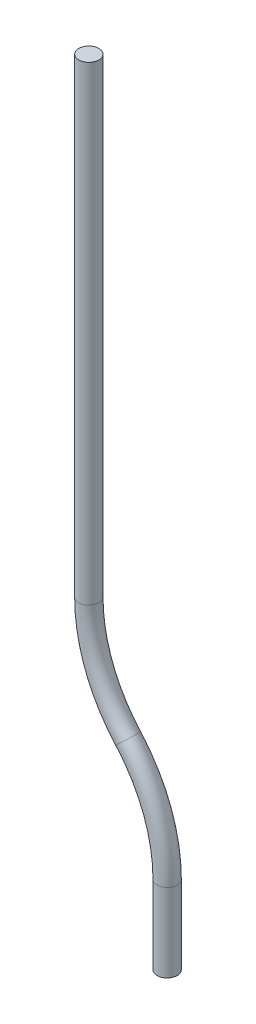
ISO-10303-21;
HEADER;
FILE_DESCRIPTION(('STEP AP214'),'2;1');
FILE_NAME('part.step','',(''),(''),'','','');
FILE_SCHEMA(('AUTOMOTIVE_DESIGN { 1 0 10303 214 1 1 1 1 }'));
ENDSEC;
DATA;
#1=APPLICATION_CONTEXT('core data for automotive mechanical design processes');
#2=APPLICATION_PROTOCOL_DEFINITION('international standard','automotive_design',2000,#1);
#3=PRODUCT_CONTEXT('',#1,'mechanical');
#4=PRODUCT('Part','Part','',(#3));
#5=PRODUCT_RELATED_PRODUCT_CATEGORY('part','',(#4));
#6=PRODUCT_DEFINITION_FORMATION('','',#4);
#7=PRODUCT_DEFINITION_CONTEXT('part definition',#1,'design');
#8=PRODUCT_DEFINITION('design','',#6,#7);
#9=PRODUCT_DEFINITION_SHAPE('','',#8);
#10=(LENGTH_UNIT() NAMED_UNIT(*) SI_UNIT(.MILLI.,.METRE.));
#11=(NAMED_UNIT(*) PLANE_ANGLE_UNIT() SI_UNIT($,.RADIAN.));
#12=(NAMED_UNIT(*) SI_UNIT($,.STERADIAN.) SOLID_ANGLE_UNIT());
#13=UNCERTAINTY_MEASURE_WITH_UNIT(LENGTH_MEASURE(1.E-05),#10,'distance_accuracy_value','');
#14=(GEOMETRIC_REPRESENTATION_CONTEXT(3) GLOBAL_UNCERTAINTY_ASSIGNED_CONTEXT((#13)) GLOBAL_UNIT_ASSIGNED_CONTEXT((#10,
#11,#12)) REPRESENTATION_CONTEXT('',''));
#15=CARTESIAN_POINT('',(0.,0.,0.));
#16=DIRECTION('',(0.,0.,1.));
#17=DIRECTION('',(1.,0.,0.));
#18=AXIS2_PLACEMENT_3D('',#15,#16,#17);
#19=CARTESIAN_POINT('',(-25.4,91.9945943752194,0.));
#20=DIRECTION('',(0.,1.,0.));
#21=DIRECTION('',(-1.,0.,0.));
#22=AXIS2_PLACEMENT_3D('',#19,#20,#21);
#23=CYLINDRICAL_SURFACE('',#22,3.25);
#24=CARTESIAN_POINT('',(-25.4,91.9945943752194,0.));
#25=DIRECTION('',(0.,1.,0.));
#26=DIRECTION('',(0.,0.,1.));
#27=AXIS2_PLACEMENT_3D('',#24,#25,#26);
#28=CIRCLE('',#27,3.25);
#29=CARTESIAN_POINT('',(-28.65,91.9945943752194,0.));
#30=VERTEX_POINT('',#29);
#31=EDGE_CURVE('E41',#30,#30,#28,.T.);
#32=CARTESIAN_POINT('',(-25.4,244.394594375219,0.));
#33=DIRECTION('',(0.,1.,0.));
#34=DIRECTION('',(0.,0.,1.));
#35=AXIS2_PLACEMENT_3D('',#32,#33,#34);
#36=CIRCLE('',#35,3.25);
#37=CARTESIAN_POINT('',(-28.65,244.394594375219,0.));
#38=VERTEX_POINT('',#37);
#39=EDGE_CURVE('E10',#38,#38,#36,.T.);
#40=CARTESIAN_POINT('',(-28.65,91.9945943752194,0.));
#41=CARTESIAN_POINT('',(-28.65,93.5820943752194,0.));
#42=CARTESIAN_POINT('',(-28.65,95.1695943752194,0.));
#43=CARTESIAN_POINT('',(-28.65,98.3445943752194,0.));
#44=CARTESIAN_POINT('',(-28.65,99.9320943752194,0.));
#45=CARTESIAN_POINT('',(-28.65,103.107094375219,0.));
#46=CARTESIAN_POINT('',(-28.65,104.694594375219,0.));
#47=CARTESIAN_POINT('',(-28.65,107.869594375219,0.));
#48=CARTESIAN_POINT('',(-28.65,109.457094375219,0.));
#49=CARTESIAN_POINT('',(-28.65,112.632094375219,0.));
#50=CARTESIAN_POINT('',(-28.65,114.219594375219,0.));
#51=CARTESIAN_POINT('',(-28.65,117.394594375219,0.));
#52=CARTESIAN_POINT('',(-28.65,118.982094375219,0.));
#53=CARTESIAN_POINT('',(-28.65,122.157094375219,0.));
#54=CARTESIAN_POINT('',(-28.65,123.744594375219,0.));
#55=CARTESIAN_POINT('',(-28.65,126.919594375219,0.));
#56=CARTESIAN_POINT('',(-28.65,128.507094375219,0.));
#57=CARTESIAN_POINT('',(-28.65,131.682094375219,0.));
#58=CARTESIAN_POINT('',(-28.65,133.269594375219,0.));
#59=CARTESIAN_POINT('',(-28.65,136.444594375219,0.));
#60=CARTESIAN_POINT('',(-28.65,138.032094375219,0.));
#61=CARTESIAN_POINT('',(-28.65,141.207094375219,0.));
#62=CARTESIAN_POINT('',(-28.65,142.794594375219,0.));
#63=CARTESIAN_POINT('',(-28.65,145.969594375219,0.));
#64=CARTESIAN_POINT('',(-28.65,147.557094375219,0.));
#65=CARTESIAN_POINT('',(-28.65,150.732094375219,0.));
#66=CARTESIAN_POINT('',(-28.65,152.319594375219,0.));
#67=CARTESIAN_POINT('',(-28.65,155.494594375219,0.));
#68=CARTESIAN_POINT('',(-28.65,157.082094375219,0.));
#69=CARTESIAN_POINT('',(-28.65,160.257094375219,0.));
#70=CARTESIAN_POINT('',(-28.65,161.844594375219,0.));
#71=CARTESIAN_POINT('',(-28.65,165.019594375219,0.));
#72=CARTESIAN_POINT('',(-28.65,166.607094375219,0.));
#73=CARTESIAN_POINT('',(-28.65,169.782094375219,0.));
#74=CARTESIAN_POINT('',(-28.65,171.369594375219,0.));
#75=CARTESIAN_POINT('',(-28.65,174.544594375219,0.));
#76=CARTESIAN_POINT('',(-28.65,176.132094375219,0.));
#77=CARTESIAN_POINT('',(-28.65,179.307094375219,0.));
#78=CARTESIAN_POINT('',(-28.65,180.894594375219,0.));
#79=CARTESIAN_POINT('',(-28.65,184.069594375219,0.));
#80=CARTESIAN_POINT('',(-28.65,185.657094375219,0.));
#81=CARTESIAN_POINT('',(-28.65,188.832094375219,0.));
#82=CARTESIAN_POINT('',(-28.65,190.419594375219,0.));
#83=CARTESIAN_POINT('',(-28.65,193.594594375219,0.));
#84=CARTESIAN_POINT('',(-28.65,195.182094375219,0.));
#85=CARTESIAN_POINT('',(-28.65,198.357094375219,0.));
#86=CARTESIAN_POINT('',(-28.65,199.944594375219,0.));
#87=CARTESIAN_POINT('',(-28.65,203.119594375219,0.));
#88=CARTESIAN_POINT('',(-28.65,204.707094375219,0.));
#89=CARTESIAN_POINT('',(-28.65,207.882094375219,0.));
#90=CARTESIAN_POINT('',(-28.65,209.469594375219,0.));
#91=CARTESIAN_POINT('',(-28.65,212.644594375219,0.));
#92=CARTESIAN_POINT('',(-28.65,214.232094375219,0.));
#93=CARTESIAN_POINT('',(-28.65,217.407094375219,0.));
#94=CARTESIAN_POINT('',(-28.65,218.994594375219,0.));
#95=CARTESIAN_POINT('',(-28.65,222.169594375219,0.));
#96=CARTESIAN_POINT('',(-28.65,223.757094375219,0.));
#97=CARTESIAN_POINT('',(-28.65,226.932094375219,0.));
#98=CARTESIAN_POINT('',(-28.65,228.519594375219,0.));
#99=CARTESIAN_POINT('',(-28.65,231.694594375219,0.));
#100=CARTESIAN_POINT('',(-28.65,233.282094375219,0.));
#101=CARTESIAN_POINT('',(-28.65,236.457094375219,0.));
#102=CARTESIAN_POINT('',(-28.65,238.044594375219,0.));
#103=CARTESIAN_POINT('',(-28.65,241.219594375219,0.));
#104=CARTESIAN_POINT('',(-28.65,242.807094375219,0.));
#105=CARTESIAN_POINT('',(-28.65,244.394594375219,0.));
#106=B_SPLINE_CURVE_WITH_KNOTS('',3,(#40,#41,#42,#43,#44,#45,#46,#47,#48,#49,#50,#51,#52,#53,
#54,#55,#56,#57,#58,#59,#60,#61,#62,#63,#64,#65,#66,#67,#68,#69,#70,#71,#72,#73,#74,#75,#76,#77,
#78,#79,#80,#81,#82,#83,#84,#85,#86,#87,#88,#89,#90,#91,#92,#93,#94,#95,#96,#97,#98,#99,#100,
#101,#102,#103,#104,#105),.UNSPECIFIED.,.F.,.F.,(4,2,2,2,2,2,2,2,2,2,2,2,2,2,2,2,2,2,2,2,2,2,2,
2,2,2,2,2,2,2,2,2,4),(0.,4.7625,9.52500000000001,14.2875,19.05,23.8125,28.575,33.3375,38.1,
42.8625,47.625,52.3875,57.15,61.9125,66.675,71.4375,76.2,80.9625,85.725,90.4875,95.25,100.0125,
104.775,109.5375,114.3,119.0625,123.825,128.5875,133.35,138.1125,142.875,147.6375,152.4),.UNSPECIFIED.);
#107=EDGE_CURVE('BSEAM34',#30,#38,#106,.T.);
#108=ORIENTED_EDGE('',*,*,#31,.T.);
#109=ORIENTED_EDGE('',*,*,#39,.F.);
#110=ORIENTED_EDGE('',*,*,#107,.T.);
#111=ORIENTED_EDGE('',*,*,#107,.F.);
#112=EDGE_LOOP('',(#108,#110,#109,#111));
#113=FACE_BOUND('',#112,.T.);
#114=ADVANCED_FACE('F34',(#113),#23,.T.);
#115=CARTESIAN_POINT('',(24.6,91.9945943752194,0.));
#116=DIRECTION('',(0.,0.,-1.));
#117=DIRECTION('',(-1.,0.,0.));
#118=AXIS2_PLACEMENT_3D('',#115,#116,#117);
#119=TOROIDAL_SURFACE('',#118,50.,3.25);
#120=CARTESIAN_POINT('',(-12.7,58.6972971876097,0.));
#121=DIRECTION('',(-0.665945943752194,0.746,0.));
#122=DIRECTION('',(0.,0.,1.));
#123=AXIS2_PLACEMENT_3D('',#120,#121,#122);
#124=CIRCLE('',#123,3.25);
#125=CARTESIAN_POINT('',(-15.1245,56.5329728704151,0.));
#126=VERTEX_POINT('',#125);
#127=EDGE_CURVE('E45',#126,#126,#124,.T.);
#128=CARTESIAN_POINT('',(24.6,91.9945943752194,0.));
#129=DIRECTION('',(0.,0.,-1.));
#130=DIRECTION('',(-1.,0.,0.));
#131=AXIS2_PLACEMENT_3D('',#128,#129,#130);
#132=CIRCLE('',#131,53.25);
#133=EDGE_CURVE('',#126,#30,#132,.T.);
#134=ORIENTED_EDGE('',*,*,#127,.T.);
#135=ORIENTED_EDGE('',*,*,#31,.F.);
#136=ORIENTED_EDGE('',*,*,#133,.T.);
#137=ORIENTED_EDGE('',*,*,#133,.F.);
#138=EDGE_LOOP('',(#134,#136,#135,#137));
#139=FACE_BOUND('',#138,.T.);
#140=ADVANCED_FACE('F76',(#139),#119,.T.);
#141=CARTESIAN_POINT('',(-50.,25.4,0.));
#142=DIRECTION('',(0.,0.,1.));
#143=DIRECTION('',(1.,0.,0.));
#144=AXIS2_PLACEMENT_3D('',#141,#142,#143);
#145=TOROIDAL_SURFACE('',#144,50.,3.25);
#146=CARTESIAN_POINT('',(0.,25.4,0.));
#147=DIRECTION('',(0.,1.,0.));
#148=DIRECTION('',(0.,0.,1.));
#149=AXIS2_PLACEMENT_3D('',#146,#147,#148);
#150=CIRCLE('',#149,3.25);
#151=CARTESIAN_POINT('',(0.,25.4,3.25));
#152=VERTEX_POINT('',#151);
#153=EDGE_CURVE('E49',#152,#152,#150,.T.);
#154=ORIENTED_EDGE('',*,*,#153,.T.);
#155=EDGE_LOOP('',(#154));
#156=FACE_BOUND('',#155,.T.);
#157=ORIENTED_EDGE('',*,*,#127,.F.);
#158=EDGE_LOOP('',(#157));
#159=FACE_BOUND('',#158,.T.);
#160=ADVANCED_FACE('F58',(#156,#159),#145,.T.);
#161=CARTESIAN_POINT('',(0.,25.4,0.));
#162=DIRECTION('',(0.,-1.,0.));
#163=DIRECTION('',(0.,0.,-1.));
#164=AXIS2_PLACEMENT_3D('',#161,#162,#163);
#165=CYLINDRICAL_SURFACE('',#164,3.25);
#166=ORIENTED_EDGE('',*,*,#153,.F.);
#167=EDGE_LOOP('',(#166));
#168=FACE_BOUND('',#167,.T.);
#169=CARTESIAN_POINT('',(0.,0.,0.));
#170=DIRECTION('',(0.,1.,0.));
#171=DIRECTION('',(0.,0.,1.));
#172=AXIS2_PLACEMENT_3D('',#169,#170,#171);
#173=CIRCLE('',#172,3.25);
#174=CARTESIAN_POINT('',(0.,0.,3.25));
#175=VERTEX_POINT('',#174);
#176=EDGE_CURVE('E52',#175,#175,#173,.T.);
#177=ORIENTED_EDGE('',*,*,#176,.T.);
#178=EDGE_LOOP('',(#177));
#179=FACE_BOUND('',#178,.T.);
#180=ADVANCED_FACE('F61',(#168,#179),#165,.T.);
#181=CARTESIAN_POINT('',(-25.4,244.394594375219,0.));
#182=DIRECTION('',(0.,1.,0.));
#183=DIRECTION('',(0.,0.,1.));
#184=AXIS2_PLACEMENT_3D('',#181,#182,#183);
#185=PLANE('',#184);
#186=ORIENTED_EDGE('',*,*,#39,.T.);
#187=EDGE_LOOP('',(#186));
#188=FACE_BOUND('',#187,.T.);
#189=ADVANCED_FACE('F64',(#188),#185,.T.);
#190=CARTESIAN_POINT('',(0.,0.,0.));
#191=DIRECTION('',(0.,1.,0.));
#192=DIRECTION('',(0.,0.,1.));
#193=AXIS2_PLACEMENT_3D('',#190,#191,#192);
#194=PLANE('',#193);
#195=ORIENTED_EDGE('',*,*,#176,.F.);
#196=EDGE_LOOP('',(#195));
#197=FACE_BOUND('',#196,.T.);
#198=ADVANCED_FACE('F68',(#197),#194,.F.);
#199=CLOSED_SHELL('',(#114,#140,#160,#180,#189,#198));
#200=MANIFOLD_SOLID_BREP('B2',#199);
#201=ADVANCED_BREP_SHAPE_REPRESENTATION('',(#18,#200),#14);
#202=SHAPE_DEFINITION_REPRESENTATION(#9,#201);
ENDSEC;
END-ISO-10303-21;
